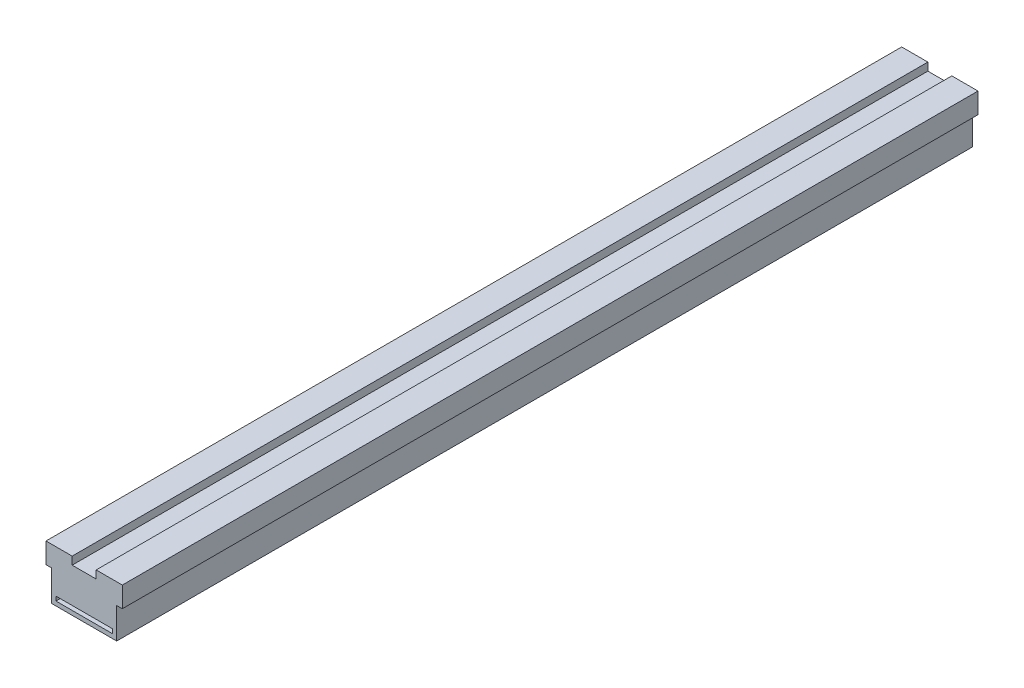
ISO-10303-21;
HEADER;
FILE_DESCRIPTION(('STEP AP214'),'2;1');
FILE_NAME('part.step','',(''),(''),'','','');
FILE_SCHEMA(('AUTOMOTIVE_DESIGN { 1 0 10303 214 1 1 1 1 }'));
ENDSEC;
DATA;
#1=APPLICATION_CONTEXT('core data for automotive mechanical design processes');
#2=APPLICATION_PROTOCOL_DEFINITION('international standard','automotive_design',2000,#1);
#3=PRODUCT_CONTEXT('',#1,'mechanical');
#4=PRODUCT('Part','Part','',(#3));
#5=PRODUCT_RELATED_PRODUCT_CATEGORY('part','',(#4));
#6=PRODUCT_DEFINITION_FORMATION('','',#4);
#7=PRODUCT_DEFINITION_CONTEXT('part definition',#1,'design');
#8=PRODUCT_DEFINITION('design','',#6,#7);
#9=PRODUCT_DEFINITION_SHAPE('','',#8);
#10=(LENGTH_UNIT() NAMED_UNIT(*) SI_UNIT(.MILLI.,.METRE.));
#11=(NAMED_UNIT(*) PLANE_ANGLE_UNIT() SI_UNIT($,.RADIAN.));
#12=(NAMED_UNIT(*) SI_UNIT($,.STERADIAN.) SOLID_ANGLE_UNIT());
#13=UNCERTAINTY_MEASURE_WITH_UNIT(LENGTH_MEASURE(1.E-05),#10,'distance_accuracy_value','');
#14=(GEOMETRIC_REPRESENTATION_CONTEXT(3) GLOBAL_UNCERTAINTY_ASSIGNED_CONTEXT((#13)) GLOBAL_UNIT_ASSIGNED_CONTEXT((#10,
#11,#12)) REPRESENTATION_CONTEXT('',''));
#15=CARTESIAN_POINT('',(0.,0.,0.));
#16=DIRECTION('',(0.,0.,1.));
#17=DIRECTION('',(1.,0.,0.));
#18=AXIS2_PLACEMENT_3D('',#15,#16,#17);
#19=CARTESIAN_POINT('',(-22.3,30.,0.));
#20=DIRECTION('',(-1.,0.,0.));
#21=DIRECTION('',(0.,0.,1.));
#22=AXIS2_PLACEMENT_3D('',#19,#20,#21);
#23=PLANE('',#22);
#24=DIRECTION('',(0.,-1.,0.));
#25=VECTOR('',#24,1.);
#26=CARTESIAN_POINT('',(-22.3,30.,500.));
#27=LINE('',#26,#25);
#28=CARTESIAN_POINT('',(-22.3,30.,500.));
#29=VERTEX_POINT('',#28);
#30=CARTESIAN_POINT('',(-22.3,18.,500.));
#31=VERTEX_POINT('',#30);
#32=EDGE_CURVE('E159',#29,#31,#27,.T.);
#33=ORIENTED_EDGE('',*,*,#32,.F.);
#34=DIRECTION('',(0.,0.,1.));
#35=VECTOR('',#34,1.);
#36=CARTESIAN_POINT('',(-22.3,30.,0.));
#37=LINE('',#36,#35);
#38=CARTESIAN_POINT('',(-22.3,30.,0.));
#39=VERTEX_POINT('',#38);
#40=EDGE_CURVE('E9',#39,#29,#37,.T.);
#41=ORIENTED_EDGE('',*,*,#40,.F.);
#42=DIRECTION('',(0.,-1.,0.));
#43=VECTOR('',#42,1.);
#44=CARTESIAN_POINT('',(-22.3,30.,0.));
#45=LINE('',#44,#43);
#46=CARTESIAN_POINT('',(-22.3,18.,0.));
#47=VERTEX_POINT('',#46);
#48=EDGE_CURVE('E163',#39,#47,#45,.T.);
#49=ORIENTED_EDGE('',*,*,#48,.T.);
#50=DIRECTION('',(0.,0.,1.));
#51=VECTOR('',#50,1.);
#52=CARTESIAN_POINT('',(-22.3,18.,0.));
#53=LINE('',#52,#51);
#54=EDGE_CURVE('E17',#47,#31,#53,.T.);
#55=ORIENTED_EDGE('',*,*,#54,.T.);
#56=EDGE_LOOP('',(#33,#41,#49,#55));
#57=FACE_BOUND('',#56,.T.);
#58=ADVANCED_FACE('F14',(#57),#23,.T.);
#59=CARTESIAN_POINT('',(-22.3,30.,0.));
#60=DIRECTION('',(0.,-1.,0.));
#61=DIRECTION('',(0.,0.,-1.));
#62=AXIS2_PLACEMENT_3D('',#59,#60,#61);
#63=PLANE('',#62);
#64=DIRECTION('',(1.,0.,0.));
#65=VECTOR('',#64,1.);
#66=CARTESIAN_POINT('',(-22.3,30.,500.));
#67=LINE('',#66,#65);
#68=CARTESIAN_POINT('',(-7.,30.,500.));
#69=VERTEX_POINT('',#68);
#70=EDGE_CURVE('E167',#29,#69,#67,.T.);
#71=ORIENTED_EDGE('',*,*,#70,.T.);
#72=DIRECTION('',(0.,0.,1.));
#73=VECTOR('',#72,1.);
#74=CARTESIAN_POINT('',(-7.,30.,0.));
#75=LINE('',#74,#73);
#76=CARTESIAN_POINT('',(-7.,30.,0.));
#77=VERTEX_POINT('',#76);
#78=EDGE_CURVE('E22',#77,#69,#75,.T.);
#79=ORIENTED_EDGE('',*,*,#78,.F.);
#80=DIRECTION('',(1.,0.,0.));
#81=VECTOR('',#80,1.);
#82=CARTESIAN_POINT('',(-22.3,30.,0.));
#83=LINE('',#82,#81);
#84=EDGE_CURVE('E192',#39,#77,#83,.T.);
#85=ORIENTED_EDGE('',*,*,#84,.F.);
#86=ORIENTED_EDGE('',*,*,#40,.T.);
#87=EDGE_LOOP('',(#71,#79,#85,#86));
#88=FACE_BOUND('',#87,.T.);
#89=ADVANCED_FACE('F260',(#88),#63,.F.);
#90=CARTESIAN_POINT('',(-7.,30.,0.));
#91=DIRECTION('',(-1.,0.,0.));
#92=DIRECTION('',(0.,0.,1.));
#93=AXIS2_PLACEMENT_3D('',#90,#91,#92);
#94=PLANE('',#93);
#95=DIRECTION('',(0.,-1.,0.));
#96=VECTOR('',#95,1.);
#97=CARTESIAN_POINT('',(-7.,30.,500.));
#98=LINE('',#97,#96);
#99=CARTESIAN_POINT('',(-7.,25.4,500.));
#100=VERTEX_POINT('',#99);
#101=EDGE_CURVE('E222',#69,#100,#98,.T.);
#102=ORIENTED_EDGE('',*,*,#101,.T.);
#103=DIRECTION('',(0.,0.,1.));
#104=VECTOR('',#103,1.);
#105=CARTESIAN_POINT('',(-7.,25.4,0.));
#106=LINE('',#105,#104);
#107=CARTESIAN_POINT('',(-7.,25.4,0.));
#108=VERTEX_POINT('',#107);
#109=EDGE_CURVE('E227',#108,#100,#106,.T.);
#110=ORIENTED_EDGE('',*,*,#109,.F.);
#111=DIRECTION('',(0.,-1.,0.));
#112=VECTOR('',#111,1.);
#113=CARTESIAN_POINT('',(-7.,30.,0.));
#114=LINE('',#113,#112);
#115=EDGE_CURVE('E190',#77,#108,#114,.T.);
#116=ORIENTED_EDGE('',*,*,#115,.F.);
#117=ORIENTED_EDGE('',*,*,#78,.T.);
#118=EDGE_LOOP('',(#102,#110,#116,#117));
#119=FACE_BOUND('',#118,.T.);
#120=ADVANCED_FACE('F264',(#119),#94,.F.);
#121=CARTESIAN_POINT('',(-7.,25.4,0.));
#122=DIRECTION('',(0.,-1.,0.));
#123=DIRECTION('',(1.,0.,0.));
#124=AXIS2_PLACEMENT_3D('',#121,#122,#123);
#125=PLANE('',#124);
#126=DIRECTION('',(1.,0.,0.));
#127=VECTOR('',#126,1.);
#128=CARTESIAN_POINT('',(-7.,25.4,500.));
#129=LINE('',#128,#127);
#130=CARTESIAN_POINT('',(7.,25.4,500.));
#131=VERTEX_POINT('',#130);
#132=EDGE_CURVE('E219',#100,#131,#129,.T.);
#133=ORIENTED_EDGE('',*,*,#132,.T.);
#134=DIRECTION('',(0.,0.,1.));
#135=VECTOR('',#134,1.);
#136=CARTESIAN_POINT('',(7.,25.4,0.));
#137=LINE('',#136,#135);
#138=CARTESIAN_POINT('',(7.,25.4,0.));
#139=VERTEX_POINT('',#138);
#140=EDGE_CURVE('E230',#139,#131,#137,.T.);
#141=ORIENTED_EDGE('',*,*,#140,.F.);
#142=DIRECTION('',(1.,0.,0.));
#143=VECTOR('',#142,1.);
#144=CARTESIAN_POINT('',(-7.,25.4,0.));
#145=LINE('',#144,#143);
#146=EDGE_CURVE('E188',#108,#139,#145,.T.);
#147=ORIENTED_EDGE('',*,*,#146,.F.);
#148=ORIENTED_EDGE('',*,*,#109,.T.);
#149=EDGE_LOOP('',(#133,#141,#147,#148));
#150=FACE_BOUND('',#149,.T.);
#151=ADVANCED_FACE('F299',(#150),#125,.F.);
#152=CARTESIAN_POINT('',(7.,30.,0.));
#153=DIRECTION('',(-1.,0.,0.));
#154=DIRECTION('',(0.,0.,1.));
#155=AXIS2_PLACEMENT_3D('',#152,#153,#154);
#156=PLANE('',#155);
#157=DIRECTION('',(0.,-1.,0.));
#158=VECTOR('',#157,1.);
#159=CARTESIAN_POINT('',(7.,30.,500.));
#160=LINE('',#159,#158);
#161=CARTESIAN_POINT('',(7.,30.,500.));
#162=VERTEX_POINT('',#161);
#163=EDGE_CURVE('E216',#162,#131,#160,.T.);
#164=ORIENTED_EDGE('',*,*,#163,.F.);
#165=DIRECTION('',(0.,0.,1.));
#166=VECTOR('',#165,1.);
#167=CARTESIAN_POINT('',(7.,30.,0.));
#168=LINE('',#167,#166);
#169=CARTESIAN_POINT('',(7.,30.,0.));
#170=VERTEX_POINT('',#169);
#171=EDGE_CURVE('E232',#170,#162,#168,.T.);
#172=ORIENTED_EDGE('',*,*,#171,.F.);
#173=DIRECTION('',(0.,-1.,0.));
#174=VECTOR('',#173,1.);
#175=CARTESIAN_POINT('',(7.,30.,0.));
#176=LINE('',#175,#174);
#177=EDGE_CURVE('E185',#170,#139,#176,.T.);
#178=ORIENTED_EDGE('',*,*,#177,.T.);
#179=ORIENTED_EDGE('',*,*,#140,.T.);
#180=EDGE_LOOP('',(#164,#172,#178,#179));
#181=FACE_BOUND('',#180,.T.);
#182=ADVANCED_FACE('F297',(#181),#156,.T.);
#183=CARTESIAN_POINT('',(7.,30.,0.));
#184=DIRECTION('',(0.,-1.,0.));
#185=DIRECTION('',(0.,0.,-1.));
#186=AXIS2_PLACEMENT_3D('',#183,#184,#185);
#187=PLANE('',#186);
#188=DIRECTION('',(1.,0.,0.));
#189=VECTOR('',#188,1.);
#190=CARTESIAN_POINT('',(7.,30.,500.));
#191=LINE('',#190,#189);
#192=CARTESIAN_POINT('',(22.3,30.,500.));
#193=VERTEX_POINT('',#192);
#194=EDGE_CURVE('E214',#162,#193,#191,.T.);
#195=ORIENTED_EDGE('',*,*,#194,.T.);
#196=DIRECTION('',(0.,0.,1.));
#197=VECTOR('',#196,1.);
#198=CARTESIAN_POINT('',(22.3,30.,0.));
#199=LINE('',#198,#197);
#200=CARTESIAN_POINT('',(22.3,30.,0.));
#201=VERTEX_POINT('',#200);
#202=EDGE_CURVE('E234',#201,#193,#199,.T.);
#203=ORIENTED_EDGE('',*,*,#202,.F.);
#204=DIRECTION('',(1.,0.,0.));
#205=VECTOR('',#204,1.);
#206=CARTESIAN_POINT('',(7.,30.,0.));
#207=LINE('',#206,#205);
#208=EDGE_CURVE('E183',#170,#201,#207,.T.);
#209=ORIENTED_EDGE('',*,*,#208,.F.);
#210=ORIENTED_EDGE('',*,*,#171,.T.);
#211=EDGE_LOOP('',(#195,#203,#209,#210));
#212=FACE_BOUND('',#211,.T.);
#213=ADVANCED_FACE('F295',(#212),#187,.F.);
#214=CARTESIAN_POINT('',(22.3,30.,0.));
#215=DIRECTION('',(-1.,0.,0.));
#216=DIRECTION('',(0.,0.,1.));
#217=AXIS2_PLACEMENT_3D('',#214,#215,#216);
#218=PLANE('',#217);
#219=DIRECTION('',(0.,-1.,0.));
#220=VECTOR('',#219,1.);
#221=CARTESIAN_POINT('',(22.3,30.,500.));
#222=LINE('',#221,#220);
#223=CARTESIAN_POINT('',(22.3,18.,500.));
#224=VERTEX_POINT('',#223);
#225=EDGE_CURVE('E211',#193,#224,#222,.T.);
#226=ORIENTED_EDGE('',*,*,#225,.T.);
#227=DIRECTION('',(0.,0.,1.));
#228=VECTOR('',#227,1.);
#229=CARTESIAN_POINT('',(22.3,18.,0.));
#230=LINE('',#229,#228);
#231=CARTESIAN_POINT('',(22.3,18.,0.));
#232=VERTEX_POINT('',#231);
#233=EDGE_CURVE('E237',#232,#224,#230,.T.);
#234=ORIENTED_EDGE('',*,*,#233,.F.);
#235=DIRECTION('',(0.,-1.,0.));
#236=VECTOR('',#235,1.);
#237=CARTESIAN_POINT('',(22.3,30.,0.));
#238=LINE('',#237,#236);
#239=EDGE_CURVE('E181',#201,#232,#238,.T.);
#240=ORIENTED_EDGE('',*,*,#239,.F.);
#241=ORIENTED_EDGE('',*,*,#202,.T.);
#242=EDGE_LOOP('',(#226,#234,#240,#241));
#243=FACE_BOUND('',#242,.T.);
#244=ADVANCED_FACE('F290',(#243),#218,.F.);
#245=CARTESIAN_POINT('',(19.,18.,0.));
#246=DIRECTION('',(0.,-1.,0.));
#247=DIRECTION('',(1.,0.,0.));
#248=AXIS2_PLACEMENT_3D('',#245,#246,#247);
#249=PLANE('',#248);
#250=DIRECTION('',(1.,0.,0.));
#251=VECTOR('',#250,1.);
#252=CARTESIAN_POINT('',(19.,18.,500.));
#253=LINE('',#252,#251);
#254=CARTESIAN_POINT('',(19.,18.,500.));
#255=VERTEX_POINT('',#254);
#256=EDGE_CURVE('E208',#255,#224,#253,.T.);
#257=ORIENTED_EDGE('',*,*,#256,.F.);
#258=DIRECTION('',(0.,0.,1.));
#259=VECTOR('',#258,1.);
#260=CARTESIAN_POINT('',(19.,18.,0.));
#261=LINE('',#260,#259);
#262=CARTESIAN_POINT('',(19.,18.,0.));
#263=VERTEX_POINT('',#262);
#264=EDGE_CURVE('E239',#263,#255,#261,.T.);
#265=ORIENTED_EDGE('',*,*,#264,.F.);
#266=DIRECTION('',(1.,0.,0.));
#267=VECTOR('',#266,1.);
#268=CARTESIAN_POINT('',(19.,18.,0.));
#269=LINE('',#268,#267);
#270=EDGE_CURVE('E178',#263,#232,#269,.T.);
#271=ORIENTED_EDGE('',*,*,#270,.T.);
#272=ORIENTED_EDGE('',*,*,#233,.T.);
#273=EDGE_LOOP('',(#257,#265,#271,#272));
#274=FACE_BOUND('',#273,.T.);
#275=ADVANCED_FACE('F284',(#274),#249,.T.);
#276=CARTESIAN_POINT('',(19.,18.,0.));
#277=DIRECTION('',(-1.,0.,0.));
#278=DIRECTION('',(0.,0.,1.));
#279=AXIS2_PLACEMENT_3D('',#276,#277,#278);
#280=PLANE('',#279);
#281=DIRECTION('',(0.,-1.,0.));
#282=VECTOR('',#281,1.);
#283=CARTESIAN_POINT('',(19.,18.,500.));
#284=LINE('',#283,#282);
#285=CARTESIAN_POINT('',(19.,0.,500.));
#286=VERTEX_POINT('',#285);
#287=EDGE_CURVE('E205',#255,#286,#284,.T.);
#288=ORIENTED_EDGE('',*,*,#287,.T.);
#289=DIRECTION('',(0.,0.,1.));
#290=VECTOR('',#289,1.);
#291=CARTESIAN_POINT('',(19.,0.,0.));
#292=LINE('',#291,#290);
#293=CARTESIAN_POINT('',(19.,0.,0.));
#294=VERTEX_POINT('',#293);
#295=EDGE_CURVE('E241',#294,#286,#292,.T.);
#296=ORIENTED_EDGE('',*,*,#295,.F.);
#297=DIRECTION('',(0.,-1.,0.));
#298=VECTOR('',#297,1.);
#299=CARTESIAN_POINT('',(19.,18.,0.));
#300=LINE('',#299,#298);
#301=EDGE_CURVE('E176',#263,#294,#300,.T.);
#302=ORIENTED_EDGE('',*,*,#301,.F.);
#303=ORIENTED_EDGE('',*,*,#264,.T.);
#304=EDGE_LOOP('',(#288,#296,#302,#303));
#305=FACE_BOUND('',#304,.T.);
#306=ADVANCED_FACE('F281',(#305),#280,.F.);
#307=CARTESIAN_POINT('',(-19.,0.,0.));
#308=DIRECTION('',(0.,-1.,0.));
#309=DIRECTION('',(0.,0.,-1.));
#310=AXIS2_PLACEMENT_3D('',#307,#308,#309);
#311=PLANE('',#310);
#312=DIRECTION('',(1.,0.,0.));
#313=VECTOR('',#312,1.);
#314=CARTESIAN_POINT('',(-19.,0.,500.));
#315=LINE('',#314,#313);
#316=CARTESIAN_POINT('',(-19.,0.,500.));
#317=VERTEX_POINT('',#316);
#318=EDGE_CURVE('E202',#317,#286,#315,.T.);
#319=ORIENTED_EDGE('',*,*,#318,.F.);
#320=DIRECTION('',(0.,0.,1.));
#321=VECTOR('',#320,1.);
#322=CARTESIAN_POINT('',(-19.,0.,0.));
#323=LINE('',#322,#321);
#324=CARTESIAN_POINT('',(-19.,0.,0.));
#325=VERTEX_POINT('',#324);
#326=EDGE_CURVE('E243',#325,#317,#323,.T.);
#327=ORIENTED_EDGE('',*,*,#326,.F.);
#328=DIRECTION('',(1.,0.,0.));
#329=VECTOR('',#328,1.);
#330=CARTESIAN_POINT('',(-19.,0.,0.));
#331=LINE('',#330,#329);
#332=EDGE_CURVE('E173',#325,#294,#331,.T.);
#333=ORIENTED_EDGE('',*,*,#332,.T.);
#334=ORIENTED_EDGE('',*,*,#295,.T.);
#335=EDGE_LOOP('',(#319,#327,#333,#334));
#336=FACE_BOUND('',#335,.T.);
#337=ADVANCED_FACE('F277',(#336),#311,.T.);
#338=CARTESIAN_POINT('',(-19.,18.,0.));
#339=DIRECTION('',(-1.,0.,0.));
#340=DIRECTION('',(0.,0.,1.));
#341=AXIS2_PLACEMENT_3D('',#338,#339,#340);
#342=PLANE('',#341);
#343=DIRECTION('',(0.,-1.,0.));
#344=VECTOR('',#343,1.);
#345=CARTESIAN_POINT('',(-19.,18.,500.));
#346=LINE('',#345,#344);
#347=CARTESIAN_POINT('',(-19.,18.,500.));
#348=VERTEX_POINT('',#347);
#349=EDGE_CURVE('E199',#348,#317,#346,.T.);
#350=ORIENTED_EDGE('',*,*,#349,.F.);
#351=DIRECTION('',(0.,0.,1.));
#352=VECTOR('',#351,1.);
#353=CARTESIAN_POINT('',(-19.,18.,0.));
#354=LINE('',#353,#352);
#355=CARTESIAN_POINT('',(-19.,18.,0.));
#356=VERTEX_POINT('',#355);
#357=EDGE_CURVE('E244',#356,#348,#354,.T.);
#358=ORIENTED_EDGE('',*,*,#357,.F.);
#359=DIRECTION('',(0.,-1.,0.));
#360=VECTOR('',#359,1.);
#361=CARTESIAN_POINT('',(-19.,18.,0.));
#362=LINE('',#361,#360);
#363=EDGE_CURVE('E170',#356,#325,#362,.T.);
#364=ORIENTED_EDGE('',*,*,#363,.T.);
#365=ORIENTED_EDGE('',*,*,#326,.T.);
#366=EDGE_LOOP('',(#350,#358,#364,#365));
#367=FACE_BOUND('',#366,.T.);
#368=ADVANCED_FACE('F272',(#367),#342,.T.);
#369=CARTESIAN_POINT('',(-22.3,18.,0.));
#370=DIRECTION('',(0.,-1.,0.));
#371=DIRECTION('',(1.,0.,0.));
#372=AXIS2_PLACEMENT_3D('',#369,#370,#371);
#373=PLANE('',#372);
#374=DIRECTION('',(1.,0.,0.));
#375=VECTOR('',#374,1.);
#376=CARTESIAN_POINT('',(-22.3,18.,500.));
#377=LINE('',#376,#375);
#378=EDGE_CURVE('E196',#31,#348,#377,.T.);
#379=ORIENTED_EDGE('',*,*,#378,.F.);
#380=ORIENTED_EDGE('',*,*,#54,.F.);
#381=DIRECTION('',(1.,0.,0.));
#382=VECTOR('',#381,1.);
#383=CARTESIAN_POINT('',(-22.3,18.,0.));
#384=LINE('',#383,#382);
#385=EDGE_CURVE('E166',#47,#356,#384,.T.);
#386=ORIENTED_EDGE('',*,*,#385,.T.);
#387=ORIENTED_EDGE('',*,*,#357,.T.);
#388=EDGE_LOOP('',(#379,#380,#386,#387));
#389=FACE_BOUND('',#388,.T.);
#390=ADVANCED_FACE('F252',(#389),#373,.T.);
#391=CARTESIAN_POINT('',(-22.3,0.,0.));
#392=DIRECTION('',(0.,0.,1.));
#393=DIRECTION('',(1.,0.,0.));
#394=AXIS2_PLACEMENT_3D('',#391,#392,#393);
#395=PLANE('',#394);
#396=DIRECTION('',(0.,-1.,0.));
#397=VECTOR('',#396,1.);
#398=CARTESIAN_POINT('',(-16.5,5.,0.));
#399=LINE('',#398,#397);
#400=CARTESIAN_POINT('',(-16.5,5.,0.));
#401=VERTEX_POINT('',#400);
#402=CARTESIAN_POINT('',(-16.5,2.5,0.));
#403=VERTEX_POINT('',#402);
#404=EDGE_CURVE('E139',#401,#403,#399,.T.);
#405=ORIENTED_EDGE('',*,*,#404,.T.);
#406=DIRECTION('',(1.,0.,0.));
#407=VECTOR('',#406,1.);
#408=CARTESIAN_POINT('',(-16.5,2.5,0.));
#409=LINE('',#408,#407);
#410=CARTESIAN_POINT('',(16.5,2.5,0.));
#411=VERTEX_POINT('',#410);
#412=EDGE_CURVE('E134',#403,#411,#409,.T.);
#413=ORIENTED_EDGE('',*,*,#412,.T.);
#414=DIRECTION('',(0.,-1.,0.));
#415=VECTOR('',#414,1.);
#416=CARTESIAN_POINT('',(16.5,5.,0.));
#417=LINE('',#416,#415);
#418=CARTESIAN_POINT('',(16.5,5.,0.));
#419=VERTEX_POINT('',#418);
#420=EDGE_CURVE('E126',#419,#411,#417,.T.);
#421=ORIENTED_EDGE('',*,*,#420,.F.);
#422=DIRECTION('',(1.,0.,0.));
#423=VECTOR('',#422,1.);
#424=CARTESIAN_POINT('',(-16.5,5.,0.));
#425=LINE('',#424,#423);
#426=EDGE_CURVE('E133',#401,#419,#425,.T.);
#427=ORIENTED_EDGE('',*,*,#426,.F.);
#428=EDGE_LOOP('',(#405,#413,#421,#427));
#429=FACE_BOUND('',#428,.T.);
#430=ORIENTED_EDGE('',*,*,#48,.F.);
#431=ORIENTED_EDGE('',*,*,#84,.T.);
#432=ORIENTED_EDGE('',*,*,#115,.T.);
#433=ORIENTED_EDGE('',*,*,#146,.T.);
#434=ORIENTED_EDGE('',*,*,#177,.F.);
#435=ORIENTED_EDGE('',*,*,#208,.T.);
#436=ORIENTED_EDGE('',*,*,#239,.T.);
#437=ORIENTED_EDGE('',*,*,#270,.F.);
#438=ORIENTED_EDGE('',*,*,#301,.T.);
#439=ORIENTED_EDGE('',*,*,#332,.F.);
#440=ORIENTED_EDGE('',*,*,#363,.F.);
#441=ORIENTED_EDGE('',*,*,#385,.F.);
#442=EDGE_LOOP('',(#430,#431,#432,#433,#434,#435,#436,#437,#438,#439,#440,#441));
#443=FACE_BOUND('',#442,.T.);
#444=ADVANCED_FACE('F141',(#429,#443),#395,.F.);
#445=CARTESIAN_POINT('',(-22.3,0.,500.));
#446=DIRECTION('',(0.,0.,1.));
#447=DIRECTION('',(1.,0.,0.));
#448=AXIS2_PLACEMENT_3D('',#445,#446,#447);
#449=PLANE('',#448);
#450=DIRECTION('',(1.,0.,0.));
#451=VECTOR('',#450,1.);
#452=CARTESIAN_POINT('',(-16.5,2.5,500.));
#453=LINE('',#452,#451);
#454=CARTESIAN_POINT('',(-16.5,2.5,500.));
#455=VERTEX_POINT('',#454);
#456=CARTESIAN_POINT('',(16.5,2.5,500.));
#457=VERTEX_POINT('',#456);
#458=EDGE_CURVE('E38',#455,#457,#453,.T.);
#459=ORIENTED_EDGE('',*,*,#458,.F.);
#460=DIRECTION('',(0.,-1.,0.));
#461=VECTOR('',#460,1.);
#462=CARTESIAN_POINT('',(-16.5,5.,500.));
#463=LINE('',#462,#461);
#464=CARTESIAN_POINT('',(-16.5,5.,500.));
#465=VERTEX_POINT('',#464);
#466=EDGE_CURVE('E144',#465,#455,#463,.T.);
#467=ORIENTED_EDGE('',*,*,#466,.F.);
#468=DIRECTION('',(1.,0.,0.));
#469=VECTOR('',#468,1.);
#470=CARTESIAN_POINT('',(-16.5,5.,500.));
#471=LINE('',#470,#469);
#472=CARTESIAN_POINT('',(16.5,5.,500.));
#473=VERTEX_POINT('',#472);
#474=EDGE_CURVE('E147',#465,#473,#471,.T.);
#475=ORIENTED_EDGE('',*,*,#474,.T.);
#476=DIRECTION('',(0.,-1.,0.));
#477=VECTOR('',#476,1.);
#478=CARTESIAN_POINT('',(16.5,5.,500.));
#479=LINE('',#478,#477);
#480=EDGE_CURVE('E153',#473,#457,#479,.T.);
#481=ORIENTED_EDGE('',*,*,#480,.T.);
#482=EDGE_LOOP('',(#459,#467,#475,#481));
#483=FACE_BOUND('',#482,.T.);
#484=ORIENTED_EDGE('',*,*,#32,.T.);
#485=ORIENTED_EDGE('',*,*,#378,.T.);
#486=ORIENTED_EDGE('',*,*,#349,.T.);
#487=ORIENTED_EDGE('',*,*,#318,.T.);
#488=ORIENTED_EDGE('',*,*,#287,.F.);
#489=ORIENTED_EDGE('',*,*,#256,.T.);
#490=ORIENTED_EDGE('',*,*,#225,.F.);
#491=ORIENTED_EDGE('',*,*,#194,.F.);
#492=ORIENTED_EDGE('',*,*,#163,.T.);
#493=ORIENTED_EDGE('',*,*,#132,.F.);
#494=ORIENTED_EDGE('',*,*,#101,.F.);
#495=ORIENTED_EDGE('',*,*,#70,.F.);
#496=EDGE_LOOP('',(#484,#485,#486,#487,#488,#489,#490,#491,#492,#493,#494,#495));
#497=FACE_BOUND('',#496,.T.);
#498=ADVANCED_FACE('F255',(#483,#497),#449,.T.);
#499=CARTESIAN_POINT('',(-16.5,2.5,0.));
#500=DIRECTION('',(0.,-1.,0.));
#501=DIRECTION('',(0.,0.,-1.));
#502=AXIS2_PLACEMENT_3D('',#499,#500,#501);
#503=PLANE('',#502);
#504=ORIENTED_EDGE('',*,*,#458,.T.);
#505=DIRECTION('',(0.,0.,1.));
#506=VECTOR('',#505,1.);
#507=CARTESIAN_POINT('',(16.5,2.5,0.));
#508=LINE('',#507,#506);
#509=EDGE_CURVE('E128',#411,#457,#508,.T.);
#510=ORIENTED_EDGE('',*,*,#509,.F.);
#511=ORIENTED_EDGE('',*,*,#412,.F.);
#512=DIRECTION('',(0.,0.,1.));
#513=VECTOR('',#512,1.);
#514=CARTESIAN_POINT('',(-16.5,2.5,0.));
#515=LINE('',#514,#513);
#516=EDGE_CURVE('E157',#403,#455,#515,.T.);
#517=ORIENTED_EDGE('',*,*,#516,.T.);
#518=EDGE_LOOP('',(#504,#510,#511,#517));
#519=FACE_BOUND('',#518,.T.);
#520=ADVANCED_FACE('F137',(#519),#503,.F.);
#521=CARTESIAN_POINT('',(-16.5,5.,0.));
#522=DIRECTION('',(-1.,0.,0.));
#523=DIRECTION('',(0.,0.,1.));
#524=AXIS2_PLACEMENT_3D('',#521,#522,#523);
#525=PLANE('',#524);
#526=ORIENTED_EDGE('',*,*,#466,.T.);
#527=ORIENTED_EDGE('',*,*,#516,.F.);
#528=ORIENTED_EDGE('',*,*,#404,.F.);
#529=DIRECTION('',(0.,0.,1.));
#530=VECTOR('',#529,1.);
#531=CARTESIAN_POINT('',(-16.5,5.,0.));
#532=LINE('',#531,#530);
#533=EDGE_CURVE('E160',#401,#465,#532,.T.);
#534=ORIENTED_EDGE('',*,*,#533,.T.);
#535=EDGE_LOOP('',(#526,#527,#528,#534));
#536=FACE_BOUND('',#535,.T.);
#537=ADVANCED_FACE('F327',(#536),#525,.F.);
#538=CARTESIAN_POINT('',(-16.5,5.,0.));
#539=DIRECTION('',(0.,-1.,0.));
#540=DIRECTION('',(0.,0.,-1.));
#541=AXIS2_PLACEMENT_3D('',#538,#539,#540);
#542=PLANE('',#541);
#543=ORIENTED_EDGE('',*,*,#474,.F.);
#544=ORIENTED_EDGE('',*,*,#533,.F.);
#545=ORIENTED_EDGE('',*,*,#426,.T.);
#546=DIRECTION('',(0.,0.,1.));
#547=VECTOR('',#546,1.);
#548=CARTESIAN_POINT('',(16.5,5.,0.));
#549=LINE('',#548,#547);
#550=EDGE_CURVE('E30',#419,#473,#549,.T.);
#551=ORIENTED_EDGE('',*,*,#550,.T.);
#552=EDGE_LOOP('',(#543,#544,#545,#551));
#553=FACE_BOUND('',#552,.T.);
#554=ADVANCED_FACE('F330',(#553),#542,.T.);
#555=CARTESIAN_POINT('',(16.5,5.,0.));
#556=DIRECTION('',(-1.,0.,0.));
#557=DIRECTION('',(0.,0.,1.));
#558=AXIS2_PLACEMENT_3D('',#555,#556,#557);
#559=PLANE('',#558);
#560=ORIENTED_EDGE('',*,*,#480,.F.);
#561=ORIENTED_EDGE('',*,*,#550,.F.);
#562=ORIENTED_EDGE('',*,*,#420,.T.);
#563=ORIENTED_EDGE('',*,*,#509,.T.);
#564=EDGE_LOOP('',(#560,#561,#562,#563));
#565=FACE_BOUND('',#564,.T.);
#566=ADVANCED_FACE('F127',(#565),#559,.T.);
#567=CLOSED_SHELL('',(#58,#89,#120,#151,#182,#213,#244,#275,#306,#337,#368,#390,#444,#498,#520,
#537,#554,#566));
#568=MANIFOLD_SOLID_BREP('B1',#567);
#569=ADVANCED_BREP_SHAPE_REPRESENTATION('',(#18,#568),#14);
#570=SHAPE_DEFINITION_REPRESENTATION(#9,#569);
ENDSEC;
END-ISO-10303-21;
